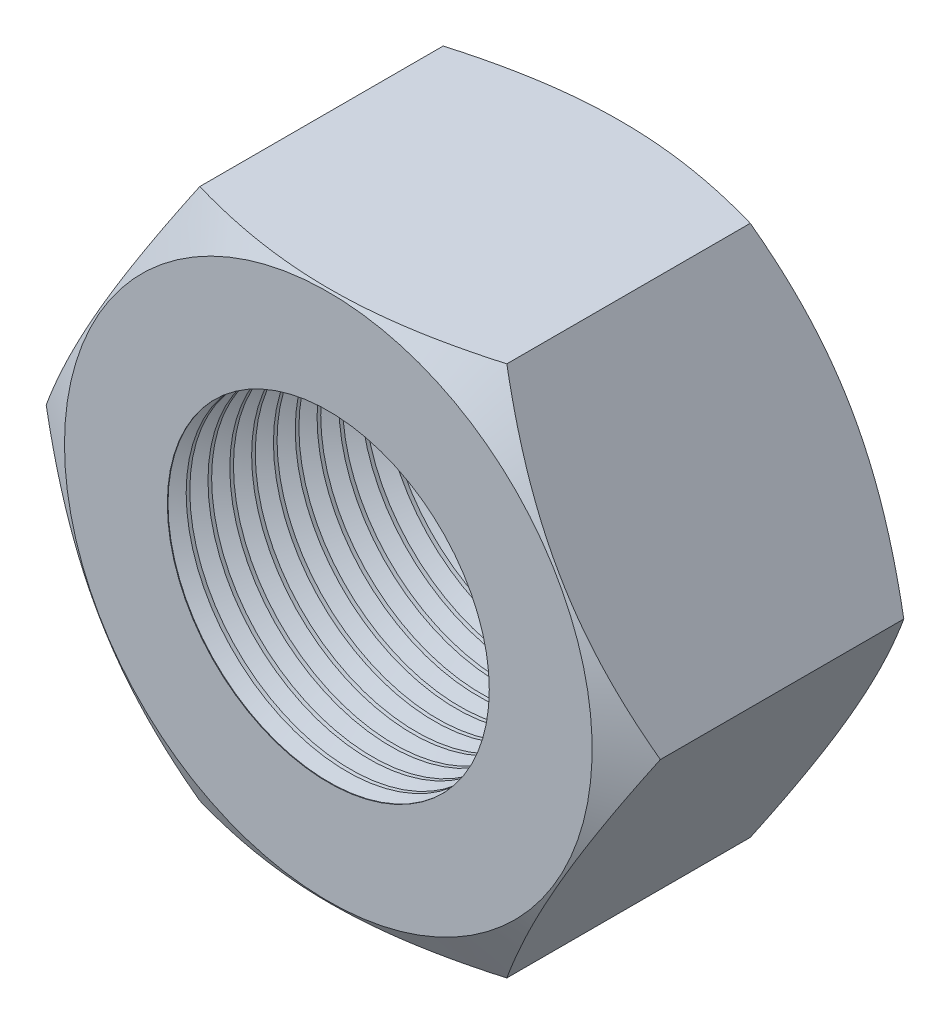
from build123d import *

# Parameters (mm, degrees)
SKETCH1_R        = 28.7525
BASENUT_DEPTH    = 52.4
LPATTERN10_COUNT = 14
LPATTERN10_PITCH = 3.897


with BuildPart() as part:
    # Sketch1 → BaseNut (new body)
    with BuildSketch(Plane.XY):
        Polygon((27.424137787, -47.5), (54.848275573, 0), (27.424137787, 47.5), (-27.424137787, 47.5), (-54.848275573, 0), (-27.424137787, -47.5), align=None)
        Circle(SKETCH1_R, mode=Mode.SUBTRACT)
    extrude(amount=-BASENUT_DEPTH)

    # Sketch2 → Double-Chamfer (revolve, cut)
    with BuildSketch(Plane(origin=(0, 0, 0), x_dir=(1, 0, 0), z_dir=(0, 1, 0))):
        Polygon((-54.848275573, 52.4), (-47.125, 52.4), (-54.848275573, 47.940964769), align=None)
        Polygon((-54.848275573, 4.459035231), (-54.848275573, 0), (-47.125, 0), align=None)
    revolve(axis=Axis((0, 0, -3.375940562), (0, 0, 1)), mode=Mode.SUBTRACT)

    # Sketch4 → Cut-Revolve10 (revolve, cut)
    with BuildSketch(Plane(origin=(0, 0, 0), x_dir=(1, 0, 0), z_dir=(0, 1, 0))):
        Polygon((31.564917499, 52.4), (28.7525, 50.77625), (25.505, 50.77625), (25.505, 54.02375), (28.7525, 54.02375), align=None)
    cut_revolve10 = revolve(axis=Axis((0, 0, 0), (0, 0, -1)), mode=Mode.SUBTRACT)

    # LPattern10: Cut-Revolve10 ×14
    with Locations(*[(0, 0, i * LPATTERN10_PITCH) for i in range(1, LPATTERN10_COUNT)]):
        add(cut_revolve10, mode=Mode.SUBTRACT)


solid = part.part
